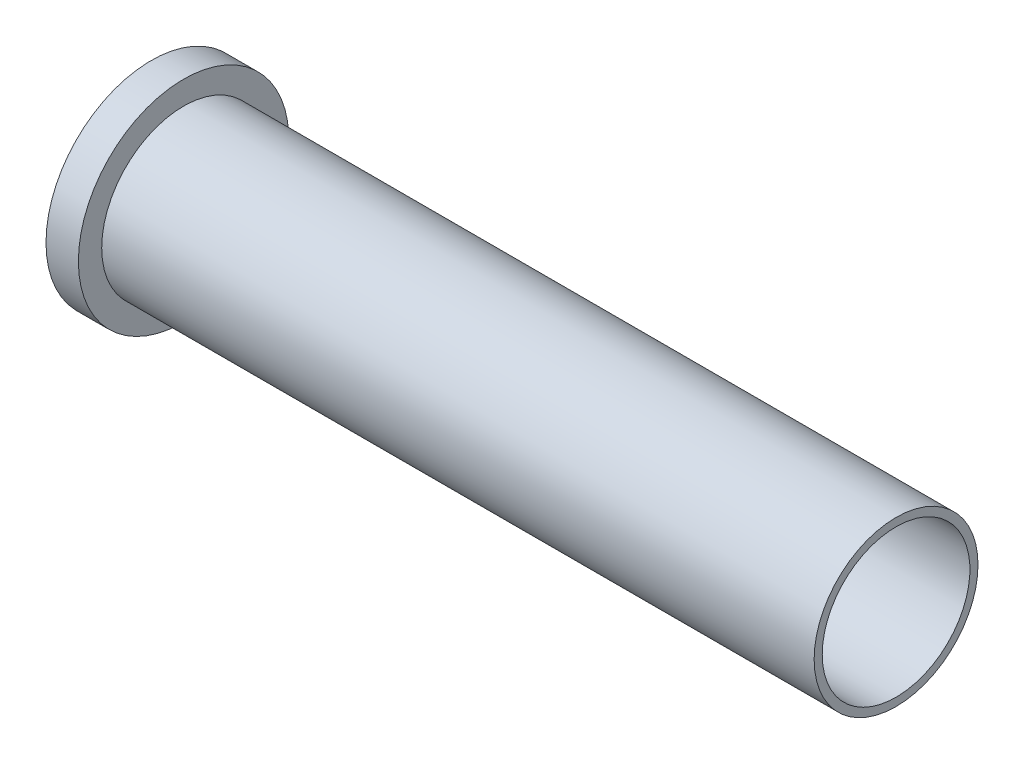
from build123d import *

# Parameters (mm, degrees)
SKETCH1_R          = 16.0655
EXTRUDE1_DEPTH     = 139.7
SKETCH2_R          = 20.6375
EXTRUDE2_DEPTH     = 6.35
SKETCH3_R          = 14.478
CUT_EXTRUDE1_DEPTH = 149.93762222


with BuildPart() as part:
    # Sketch1 → Extrude1 (new body)
    with BuildSketch(Plane(origin=(0, 0, 0), x_dir=(0, 0, -1), z_dir=(1, 0, 0))):
        Circle(SKETCH1_R)
    extrude(amount=EXTRUDE1_DEPTH)

    # Sketch2 → Extrude2 (add)
    with BuildSketch(Plane.ZY):
        Circle(SKETCH2_R)
    extrude(amount=EXTRUDE2_DEPTH)

    # Sketch3 → Cut-Extrude1 (cut, through all)
    with BuildSketch(Plane.ZY.offset(6.35)):
        Circle(SKETCH3_R)
    extrude(amount=-CUT_EXTRUDE1_DEPTH, mode=Mode.SUBTRACT)


solid = part.part
